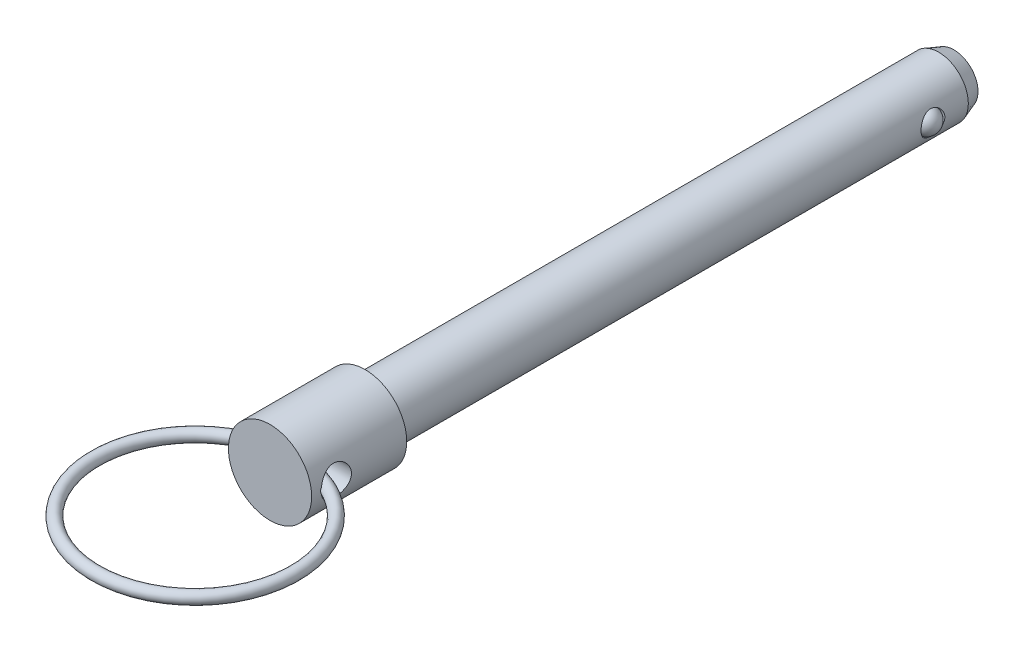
ISO-10303-21;
HEADER;
FILE_DESCRIPTION(('STEP AP214'),'2;1');
FILE_NAME('part.step','',(''),(''),'','','');
FILE_SCHEMA(('AUTOMOTIVE_DESIGN { 1 0 10303 214 1 1 1 1 }'));
ENDSEC;
DATA;
#1=APPLICATION_CONTEXT('core data for automotive mechanical design processes');
#2=APPLICATION_PROTOCOL_DEFINITION('international standard','automotive_design',2000,#1);
#3=PRODUCT_CONTEXT('',#1,'mechanical');
#4=PRODUCT('Part','Part','',(#3));
#5=PRODUCT_RELATED_PRODUCT_CATEGORY('part','',(#4));
#6=PRODUCT_DEFINITION_FORMATION('','',#4);
#7=PRODUCT_DEFINITION_CONTEXT('part definition',#1,'design');
#8=PRODUCT_DEFINITION('design','',#6,#7);
#9=PRODUCT_DEFINITION_SHAPE('','',#8);
#10=(LENGTH_UNIT() NAMED_UNIT(*) SI_UNIT(.MILLI.,.METRE.));
#11=(NAMED_UNIT(*) PLANE_ANGLE_UNIT() SI_UNIT($,.RADIAN.));
#12=(NAMED_UNIT(*) SI_UNIT($,.STERADIAN.) SOLID_ANGLE_UNIT());
#13=UNCERTAINTY_MEASURE_WITH_UNIT(LENGTH_MEASURE(1.E-05),#10,'distance_accuracy_value','');
#14=(GEOMETRIC_REPRESENTATION_CONTEXT(3) GLOBAL_UNCERTAINTY_ASSIGNED_CONTEXT((#13)) GLOBAL_UNIT_ASSIGNED_CONTEXT((#10,
#11,#12)) REPRESENTATION_CONTEXT('',''));
#15=CARTESIAN_POINT('',(0.,0.,0.));
#16=DIRECTION('',(0.,0.,1.));
#17=DIRECTION('',(1.,0.,0.));
#18=AXIS2_PLACEMENT_3D('',#15,#16,#17);
#19=CARTESIAN_POINT('',(7.9375,0.,9.398));
#20=DIRECTION('',(-1.,0.,0.));
#21=DIRECTION('',(0.,0.,-1.));
#22=AXIS2_PLACEMENT_3D('',#19,#20,#21);
#23=CYLINDRICAL_SURFACE('',#22,2.0193);
#24=CARTESIAN_POINT('',(-5.55645,0.41338820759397,11.3745329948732));
#25=CARTESIAN_POINT('',(-5.53323669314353,0.388835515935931,11.3796705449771));
#26=CARTESIAN_POINT('',(-5.51157389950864,0.362641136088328,11.3846690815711));
#27=CARTESIAN_POINT('',(-5.47216390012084,0.307044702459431,11.3940198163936));
#28=CARTESIAN_POINT('',(-5.45444977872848,0.277618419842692,11.3983664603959));
#29=CARTESIAN_POINT('',(-5.42406600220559,0.215851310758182,11.4059720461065));
#30=CARTESIAN_POINT('',(-5.41142802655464,0.183493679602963,11.4092241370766));
#31=CARTESIAN_POINT('',(-5.3923512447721,0.116986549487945,11.4141821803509));
#32=CARTESIAN_POINT('',(-5.38588919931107,0.0828442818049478,11.4158939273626));
#33=CARTESIAN_POINT('',(-5.3799561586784,0.017298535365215,11.4174656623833));
#34=CARTESIAN_POINT('',(-5.37986165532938,-0.0140451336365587,11.4174908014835));
#35=CARTESIAN_POINT('',(-5.38511249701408,-0.0762532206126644,11.4160995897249));
#36=CARTESIAN_POINT('',(-5.39046041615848,-0.107117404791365,11.4146825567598));
#37=CARTESIAN_POINT('',(-5.40574321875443,-0.165640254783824,11.4106965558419));
#38=CARTESIAN_POINT('',(-5.41539031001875,-0.193380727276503,11.408200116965));
#39=CARTESIAN_POINT('',(-5.43862859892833,-0.24707398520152,11.4023097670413));
#40=CARTESIAN_POINT('',(-5.45222392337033,-0.273024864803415,11.398914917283));
#41=CARTESIAN_POINT('',(-5.48024922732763,-0.318737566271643,11.3920973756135));
#42=CARTESIAN_POINT('',(-5.49418727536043,-0.338820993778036,11.3887682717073));
#43=CARTESIAN_POINT('',(-5.523970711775,-0.377330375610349,11.3818282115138));
#44=CARTESIAN_POINT('',(-5.53980753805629,-0.395763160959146,11.378218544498));
#45=CARTESIAN_POINT('',(-5.55645,-0.413388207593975,11.3745329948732));
#46=B_SPLINE_CURVE_WITH_KNOTS('',3,(#24,#25,#26,#27,#28,#29,#30,#31,#32,#33,#34,#35,#36,#37,#38,
#39,#40,#41,#42,#43,#44,#45),.UNSPECIFIED.,.F.,.F.,(4,2,2,2,2,2,2,2,2,2,4),(0.,
0.102621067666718,0.206072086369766,0.310159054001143,0.413852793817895,0.50737645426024,
0.600944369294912,0.689017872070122,0.777183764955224,0.851068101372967,0.924630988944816),.UNSPECIFIED.);
#47=CARTESIAN_POINT('',(-5.54200209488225,0.397651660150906,11.3777589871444));
#48=VERTEX_POINT('',#47);
#49=CARTESIAN_POINT('',(-5.54200209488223,-0.397651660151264,11.3777589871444));
#50=VERTEX_POINT('',#49);
#51=EDGE_CURVE('E40',#48,#50,#46,.T.);
#52=ORIENTED_EDGE('',*,*,#51,.F.);
#53=CARTESIAN_POINT('',(-5.55625,0.,11.4173));
#54=CARTESIAN_POINT('',(-5.55624527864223,-0.109432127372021,11.4172937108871));
#55=CARTESIAN_POINT('',(-5.55298237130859,-0.218969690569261,11.408361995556));
#56=CARTESIAN_POINT('',(-5.54026368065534,-0.434902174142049,11.372953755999));
#57=CARTESIAN_POINT('',(-5.53079819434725,-0.541291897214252,11.3464497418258));
#58=CARTESIAN_POINT('',(-5.50670156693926,-0.747605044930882,11.2769560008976));
#59=CARTESIAN_POINT('',(-5.49208344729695,-0.847544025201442,11.2340078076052));
#60=CARTESIAN_POINT('',(-5.45915039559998,-1.03875753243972,11.1330083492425));
#61=CARTESIAN_POINT('',(-5.44083572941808,-1.13003268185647,11.0749581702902));
#62=CARTESIAN_POINT('',(-5.4015811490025,-1.30505728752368,10.9429422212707));
#63=CARTESIAN_POINT('',(-5.38056990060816,-1.38841141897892,10.8684736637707));
#64=CARTESIAN_POINT('',(-5.33865236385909,-1.54176439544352,10.7067995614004));
#65=CARTESIAN_POINT('',(-5.31774611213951,-1.61175885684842,10.6195898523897));
#66=CARTESIAN_POINT('',(-5.27759352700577,-1.73882919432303,10.4311528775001));
#67=CARTESIAN_POINT('',(-5.25843183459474,-1.79536185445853,10.3295394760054));
#68=CARTESIAN_POINT('',(-5.22503611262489,-1.89036141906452,10.1174402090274));
#69=CARTESIAN_POINT('',(-5.21080023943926,-1.92883508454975,10.0069576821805));
#70=CARTESIAN_POINT('',(-5.18962447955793,-1.98509166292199,9.78477737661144));
#71=CARTESIAN_POINT('',(-5.18242178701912,-2.00362275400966,9.67329490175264));
#72=CARTESIAN_POINT('',(-5.17535625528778,-2.02180769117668,9.44858805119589));
#73=CARTESIAN_POINT('',(-5.17549061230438,-2.02146874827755,9.33536435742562));
#74=CARTESIAN_POINT('',(-5.18285629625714,-2.00249790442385,9.11709454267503));
#75=CARTESIAN_POINT('',(-5.18969215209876,-1.98488533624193,9.01194405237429));
#76=CARTESIAN_POINT('',(-5.20903632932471,-1.93354575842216,8.80620743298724));
#77=CARTESIAN_POINT('',(-5.22154547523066,-1.89981640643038,8.70562196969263));
#78=CARTESIAN_POINT('',(-5.25107746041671,-1.81661001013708,8.50972358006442));
#79=CARTESIAN_POINT('',(-5.26817827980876,-1.76685762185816,8.41453987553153));
#80=CARTESIAN_POINT('',(-5.30493780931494,-1.65321144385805,8.23357336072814));
#81=CARTESIAN_POINT('',(-5.32459724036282,-1.58931366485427,8.14779321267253));
#82=CARTESIAN_POINT('',(-5.36576425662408,-1.44447059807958,7.98240722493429));
#83=CARTESIAN_POINT('',(-5.38731044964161,-1.36270785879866,7.90352531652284));
#84=CARTESIAN_POINT('',(-5.42876622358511,-1.18682967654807,7.76035905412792));
#85=CARTESIAN_POINT('',(-5.44867505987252,-1.09270866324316,7.69608131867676));
#86=CARTESIAN_POINT('',(-5.48497084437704,-0.893001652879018,7.58320896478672));
#87=CARTESIAN_POINT('',(-5.5013029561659,-0.787270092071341,7.53485348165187));
#88=CARTESIAN_POINT('',(-5.52817729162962,-0.568540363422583,7.4569293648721));
#89=CARTESIAN_POINT('',(-5.53873126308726,-0.455557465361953,7.42732259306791));
#90=CARTESIAN_POINT('',(-5.54924569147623,-0.284581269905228,7.39803699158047));
#91=CARTESIAN_POINT('',(-5.55186369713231,-0.227949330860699,7.3907957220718));
#92=CARTESIAN_POINT('',(-5.55536708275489,-0.114221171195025,7.3811255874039));
#93=CARTESIAN_POINT('',(-5.55625246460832,-0.0571249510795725,7.37869671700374));
#94=CARTESIAN_POINT('',(-5.55624527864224,0.109432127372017,7.37870628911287));
#95=CARTESIAN_POINT('',(-5.55298237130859,0.218969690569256,7.38763800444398));
#96=CARTESIAN_POINT('',(-5.54026368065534,0.434902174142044,7.42304624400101));
#97=CARTESIAN_POINT('',(-5.53079819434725,0.541291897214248,7.44955025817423));
#98=CARTESIAN_POINT('',(-5.50670156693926,0.747605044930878,7.51904399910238));
#99=CARTESIAN_POINT('',(-5.49208344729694,0.847544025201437,7.56199219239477));
#100=CARTESIAN_POINT('',(-5.45915039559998,1.03875753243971,7.66299165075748));
#101=CARTESIAN_POINT('',(-5.44083572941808,1.13003268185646,7.72104182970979));
#102=CARTESIAN_POINT('',(-5.4015811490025,1.30505728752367,7.85305777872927));
#103=CARTESIAN_POINT('',(-5.38056990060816,1.38841141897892,7.92752633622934));
#104=CARTESIAN_POINT('',(-5.33865236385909,1.54176439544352,8.08920043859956));
#105=CARTESIAN_POINT('',(-5.31774611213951,1.61175885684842,8.17641014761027));
#106=CARTESIAN_POINT('',(-5.27759352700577,1.73882919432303,8.36484712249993));
#107=CARTESIAN_POINT('',(-5.25843183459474,1.79536185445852,8.46646052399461));
#108=CARTESIAN_POINT('',(-5.22503611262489,1.89036141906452,8.67855979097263));
#109=CARTESIAN_POINT('',(-5.21080023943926,1.92883508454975,8.78904231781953));
#110=CARTESIAN_POINT('',(-5.18962447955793,1.98509166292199,9.01122262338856));
#111=CARTESIAN_POINT('',(-5.18242178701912,2.00362275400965,9.12270509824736));
#112=CARTESIAN_POINT('',(-5.17535625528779,2.02180769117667,9.34741194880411));
#113=CARTESIAN_POINT('',(-5.17549061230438,2.02146874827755,9.46063564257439));
#114=CARTESIAN_POINT('',(-5.18285629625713,2.00249790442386,9.67890545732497));
#115=CARTESIAN_POINT('',(-5.18969215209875,1.98488533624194,9.78405594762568));
#116=CARTESIAN_POINT('',(-5.20903632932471,1.93354575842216,9.98979256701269));
#117=CARTESIAN_POINT('',(-5.22154547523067,1.89981640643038,10.0903780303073));
#118=CARTESIAN_POINT('',(-5.25107746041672,1.81661001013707,10.2862764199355));
#119=CARTESIAN_POINT('',(-5.26817827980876,1.76685762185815,10.3814601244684));
#120=CARTESIAN_POINT('',(-5.30493780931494,1.65321144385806,10.5624266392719));
#121=CARTESIAN_POINT('',(-5.32459724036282,1.58931366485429,10.6482067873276));
#122=CARTESIAN_POINT('',(-5.36576425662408,1.44447059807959,10.8135927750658));
#123=CARTESIAN_POINT('',(-5.38731044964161,1.36270785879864,10.8924746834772));
#124=CARTESIAN_POINT('',(-5.42876622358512,1.18682967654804,11.0356409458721));
#125=CARTESIAN_POINT('',(-5.44867505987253,1.09270866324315,11.0999186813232));
#126=CARTESIAN_POINT('',(-5.48497084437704,0.893001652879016,11.2127910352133));
#127=CARTESIAN_POINT('',(-5.5013029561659,0.787270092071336,11.2611465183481));
#128=CARTESIAN_POINT('',(-5.52817729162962,0.568540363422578,11.3390706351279));
#129=CARTESIAN_POINT('',(-5.53873126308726,0.455557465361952,11.3686774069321));
#130=CARTESIAN_POINT('',(-5.54924569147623,0.284581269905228,11.3979630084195));
#131=CARTESIAN_POINT('',(-5.55186369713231,0.227949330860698,11.4052042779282));
#132=CARTESIAN_POINT('',(-5.5553670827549,0.114221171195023,11.4148744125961));
#133=CARTESIAN_POINT('',(-5.55625246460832,0.0571249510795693,11.4173032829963));
#134=CARTESIAN_POINT('',(-5.55625,0.,11.4173));
#135=B_SPLINE_CURVE_WITH_KNOTS('',3,(#53,#54,#55,#56,#57,#58,#59,#60,#61,#62,#63,#64,#65,#66,
#67,#68,#69,#70,#71,#72,#73,#74,#75,#76,#77,#78,#79,#80,#81,#82,#83,#84,#85,#86,#87,#88,#89,#90,
#91,#92,#93,#94,#95,#96,#97,#98,#99,#100,#101,#102,#103,#104,#105,#106,#107,#108,#109,#110,#111,
#112,#113,#114,#115,#116,#117,#118,#119,#120,#121,#122,#123,#124,#125,#126,#127,#128,#129,#130,
#131,#132,#133,#134),.UNSPECIFIED.,.T.,.F.,(4,2,2,2,2,2,2,2,2,2,2,2,2,2,2,2,2,2,2,2,2,2,2,2,2,2,
2,2,2,2,2,2,2,2,2,2,2,2,2,2,4),(0.,0.328075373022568,0.656665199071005,0.984430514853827,
1.31217226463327,1.65185430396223,1.99164760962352,2.3434350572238,2.69509069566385,
3.03303658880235,3.3708533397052,3.68986542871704,4.00892389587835,4.33378721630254,
4.65874227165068,5.00406386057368,5.34954163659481,5.69999369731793,6.04973056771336,
6.22099023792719,6.39224972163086,6.72032509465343,7.04891492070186,7.37668023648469,
7.70442198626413,8.04410402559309,8.38389733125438,8.73568477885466,9.08734041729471,
9.42528631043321,9.76310306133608,10.0821151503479,10.4011736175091,10.7260369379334,
11.0509919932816,11.3963135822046,11.7417913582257,12.0922434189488,12.4419802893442,
12.6132399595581,12.7844994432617),.UNSPECIFIED.);
#136=EDGE_CURVE('E66',#50,#48,#135,.T.);
#137=ORIENTED_EDGE('',*,*,#136,.F.);
#138=EDGE_LOOP('',(#52,#137));
#139=FACE_BOUND('',#138,.T.);
#140=CARTESIAN_POINT('',(5.55645,-0.413388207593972,11.3745329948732));
#141=CARTESIAN_POINT('',(5.53323669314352,-0.388835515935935,11.3796705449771));
#142=CARTESIAN_POINT('',(5.51157389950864,-0.362641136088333,11.3846690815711));
#143=CARTESIAN_POINT('',(5.47216390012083,-0.307044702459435,11.3940198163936));
#144=CARTESIAN_POINT('',(5.45444977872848,-0.277618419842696,11.3983664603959));
#145=CARTESIAN_POINT('',(5.42406600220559,-0.215851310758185,11.4059720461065));
#146=CARTESIAN_POINT('',(5.41142802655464,-0.183493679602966,11.4092241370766));
#147=CARTESIAN_POINT('',(5.3923512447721,-0.116986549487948,11.4141821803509));
#148=CARTESIAN_POINT('',(5.38588919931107,-0.0828442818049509,11.4158939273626));
#149=CARTESIAN_POINT('',(5.3799561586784,-0.0172985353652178,11.4174656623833));
#150=CARTESIAN_POINT('',(5.37986165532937,0.0140451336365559,11.4174908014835));
#151=CARTESIAN_POINT('',(5.38511249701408,0.0762532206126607,11.4160995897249));
#152=CARTESIAN_POINT('',(5.39046041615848,0.10711740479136,11.4146825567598));
#153=CARTESIAN_POINT('',(5.40574321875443,0.16564025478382,11.4106965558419));
#154=CARTESIAN_POINT('',(5.41539031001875,0.193380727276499,11.408200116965));
#155=CARTESIAN_POINT('',(5.43862859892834,0.247073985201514,11.4023097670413));
#156=CARTESIAN_POINT('',(5.45222392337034,0.273024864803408,11.398914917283));
#157=CARTESIAN_POINT('',(5.48024922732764,0.318737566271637,11.3920973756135));
#158=CARTESIAN_POINT('',(5.49418727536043,0.338820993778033,11.3887682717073));
#159=CARTESIAN_POINT('',(5.523970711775,0.377330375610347,11.3818282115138));
#160=CARTESIAN_POINT('',(5.53980753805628,0.395763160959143,11.378218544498));
#161=CARTESIAN_POINT('',(5.55645,0.413388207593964,11.3745329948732));
#162=B_SPLINE_CURVE_WITH_KNOTS('',3,(#140,#141,#142,#143,#144,#145,#146,#147,#148,#149,#150,
#151,#152,#153,#154,#155,#156,#157,#158,#159,#160,#161),.UNSPECIFIED.,.F.,.F.,(4,2,2,2,2,2,2,2,
2,2,4),(0.,0.102621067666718,0.206072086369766,0.310159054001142,0.413852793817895,
0.507376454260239,0.60094436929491,0.689017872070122,0.777183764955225,0.851068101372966,
0.924630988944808),.UNSPECIFIED.);
#163=CARTESIAN_POINT('',(5.54200209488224,-0.397651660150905,11.3777589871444));
#164=VERTEX_POINT('',#163);
#165=CARTESIAN_POINT('',(5.54200209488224,0.397651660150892,11.3777589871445));
#166=VERTEX_POINT('',#165);
#167=EDGE_CURVE('E33',#164,#166,#162,.T.);
#168=ORIENTED_EDGE('',*,*,#167,.F.);
#169=CARTESIAN_POINT('',(5.55625,0.,7.3787));
#170=CARTESIAN_POINT('',(5.55624527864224,-0.109432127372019,7.37870628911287));
#171=CARTESIAN_POINT('',(5.55298237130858,-0.218969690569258,7.38763800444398));
#172=CARTESIAN_POINT('',(5.54026368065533,-0.434902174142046,7.42304624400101));
#173=CARTESIAN_POINT('',(5.53079819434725,-0.54129189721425,7.44955025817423));
#174=CARTESIAN_POINT('',(5.50670156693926,-0.74760504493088,7.51904399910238));
#175=CARTESIAN_POINT('',(5.49208344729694,-0.847544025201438,7.56199219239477));
#176=CARTESIAN_POINT('',(5.45915039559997,-1.03875753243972,7.66299165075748));
#177=CARTESIAN_POINT('',(5.44083572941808,-1.13003268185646,7.72104182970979));
#178=CARTESIAN_POINT('',(5.4015811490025,-1.30505728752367,7.85305777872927));
#179=CARTESIAN_POINT('',(5.38056990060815,-1.38841141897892,7.92752633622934));
#180=CARTESIAN_POINT('',(5.33865236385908,-1.54176439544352,8.08920043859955));
#181=CARTESIAN_POINT('',(5.31774611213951,-1.61175885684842,8.17641014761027));
#182=CARTESIAN_POINT('',(5.27759352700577,-1.73882919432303,8.36484712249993));
#183=CARTESIAN_POINT('',(5.25843183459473,-1.79536185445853,8.46646052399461));
#184=CARTESIAN_POINT('',(5.22503611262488,-1.89036141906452,8.67855979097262));
#185=CARTESIAN_POINT('',(5.21080023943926,-1.92883508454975,8.78904231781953));
#186=CARTESIAN_POINT('',(5.18962447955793,-1.98509166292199,9.01122262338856));
#187=CARTESIAN_POINT('',(5.18242178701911,-2.00362275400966,9.12270509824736));
#188=CARTESIAN_POINT('',(5.17535625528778,-2.02180769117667,9.34741194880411));
#189=CARTESIAN_POINT('',(5.17549061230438,-2.02146874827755,9.46063564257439));
#190=CARTESIAN_POINT('',(5.18285629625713,-2.00249790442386,9.67890545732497));
#191=CARTESIAN_POINT('',(5.18969215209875,-1.98488533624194,9.78405594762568));
#192=CARTESIAN_POINT('',(5.2090363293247,-1.93354575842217,9.98979256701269));
#193=CARTESIAN_POINT('',(5.22154547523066,-1.89981640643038,10.0903780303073));
#194=CARTESIAN_POINT('',(5.25107746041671,-1.81661001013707,10.2862764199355));
#195=CARTESIAN_POINT('',(5.26817827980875,-1.76685762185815,10.3814601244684));
#196=CARTESIAN_POINT('',(5.30493780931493,-1.65321144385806,10.5624266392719));
#197=CARTESIAN_POINT('',(5.32459724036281,-1.58931366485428,10.6482067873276));
#198=CARTESIAN_POINT('',(5.36576425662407,-1.44447059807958,10.8135927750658));
#199=CARTESIAN_POINT('',(5.3873104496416,-1.36270785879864,10.8924746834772));
#200=CARTESIAN_POINT('',(5.42876622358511,-1.18682967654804,11.0356409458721));
#201=CARTESIAN_POINT('',(5.44867505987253,-1.09270866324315,11.0999186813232));
#202=CARTESIAN_POINT('',(5.48497084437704,-0.893001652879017,11.2127910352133));
#203=CARTESIAN_POINT('',(5.50130295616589,-0.787270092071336,11.2611465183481));
#204=CARTESIAN_POINT('',(5.52817729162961,-0.568540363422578,11.3390706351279));
#205=CARTESIAN_POINT('',(5.53873126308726,-0.455557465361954,11.3686774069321));
#206=CARTESIAN_POINT('',(5.54924569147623,-0.28458126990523,11.3979630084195));
#207=CARTESIAN_POINT('',(5.5518636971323,-0.2279493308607,11.4052042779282));
#208=CARTESIAN_POINT('',(5.55536708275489,-0.114221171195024,11.4148744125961));
#209=CARTESIAN_POINT('',(5.55625246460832,-0.0571249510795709,11.4173032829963));
#210=CARTESIAN_POINT('',(5.55624527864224,0.109432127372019,11.4172937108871));
#211=CARTESIAN_POINT('',(5.55298237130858,0.218969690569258,11.408361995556));
#212=CARTESIAN_POINT('',(5.54026368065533,0.434902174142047,11.372953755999));
#213=CARTESIAN_POINT('',(5.53079819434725,0.54129189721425,11.3464497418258));
#214=CARTESIAN_POINT('',(5.50670156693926,0.747605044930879,11.2769560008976));
#215=CARTESIAN_POINT('',(5.49208344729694,0.847544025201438,11.2340078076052));
#216=CARTESIAN_POINT('',(5.45915039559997,1.03875753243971,11.1330083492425));
#217=CARTESIAN_POINT('',(5.44083572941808,1.13003268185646,11.0749581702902));
#218=CARTESIAN_POINT('',(5.4015811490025,1.30505728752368,10.9429422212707));
#219=CARTESIAN_POINT('',(5.38056990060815,1.38841141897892,10.8684736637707));
#220=CARTESIAN_POINT('',(5.33865236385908,1.54176439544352,10.7067995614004));
#221=CARTESIAN_POINT('',(5.31774611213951,1.61175885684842,10.6195898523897));
#222=CARTESIAN_POINT('',(5.27759352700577,1.73882919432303,10.4311528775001));
#223=CARTESIAN_POINT('',(5.25843183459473,1.79536185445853,10.3295394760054));
#224=CARTESIAN_POINT('',(5.22503611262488,1.89036141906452,10.1174402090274));
#225=CARTESIAN_POINT('',(5.21080023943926,1.92883508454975,10.0069576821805));
#226=CARTESIAN_POINT('',(5.18962447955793,1.98509166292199,9.78477737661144));
#227=CARTESIAN_POINT('',(5.18242178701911,2.00362275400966,9.67329490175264));
#228=CARTESIAN_POINT('',(5.17535625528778,2.02180769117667,9.44858805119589));
#229=CARTESIAN_POINT('',(5.17549061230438,2.02146874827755,9.33536435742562));
#230=CARTESIAN_POINT('',(5.18285629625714,2.00249790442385,9.11709454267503));
#231=CARTESIAN_POINT('',(5.18969215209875,1.98488533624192,9.01194405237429));
#232=CARTESIAN_POINT('',(5.2090363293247,1.93354575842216,8.80620743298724));
#233=CARTESIAN_POINT('',(5.22154547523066,1.89981640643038,8.70562196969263));
#234=CARTESIAN_POINT('',(5.25107746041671,1.81661001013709,8.50972358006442));
#235=CARTESIAN_POINT('',(5.26817827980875,1.76685762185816,8.41453987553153));
#236=CARTESIAN_POINT('',(5.30493780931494,1.65321144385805,8.23357336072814));
#237=CARTESIAN_POINT('',(5.32459724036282,1.58931366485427,8.14779321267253));
#238=CARTESIAN_POINT('',(5.36576425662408,1.44447059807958,7.98240722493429));
#239=CARTESIAN_POINT('',(5.3873104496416,1.36270785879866,7.90352531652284));
#240=CARTESIAN_POINT('',(5.4287662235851,1.18682967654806,7.76035905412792));
#241=CARTESIAN_POINT('',(5.44867505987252,1.09270866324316,7.69608131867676));
#242=CARTESIAN_POINT('',(5.48497084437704,0.893001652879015,7.58320896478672));
#243=CARTESIAN_POINT('',(5.50130295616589,0.787270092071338,7.53485348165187));
#244=CARTESIAN_POINT('',(5.52817729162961,0.568540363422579,7.4569293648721));
#245=CARTESIAN_POINT('',(5.53873126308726,0.45555746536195,7.42732259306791));
#246=CARTESIAN_POINT('',(5.54924569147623,0.284581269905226,7.39803699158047));
#247=CARTESIAN_POINT('',(5.5518636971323,0.227949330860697,7.3907957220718));
#248=CARTESIAN_POINT('',(5.55536708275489,0.114221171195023,7.3811255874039));
#249=CARTESIAN_POINT('',(5.55625246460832,0.05712495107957,7.37869671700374));
#250=CARTESIAN_POINT('',(5.55625,0.,7.3787));
#251=B_SPLINE_CURVE_WITH_KNOTS('',3,(#169,#170,#171,#172,#173,#174,#175,#176,#177,#178,#179,
#180,#181,#182,#183,#184,#185,#186,#187,#188,#189,#190,#191,#192,#193,#194,#195,#196,#197,#198,
#199,#200,#201,#202,#203,#204,#205,#206,#207,#208,#209,#210,#211,#212,#213,#214,#215,#216,#217,
#218,#219,#220,#221,#222,#223,#224,#225,#226,#227,#228,#229,#230,#231,#232,#233,#234,#235,#236,
#237,#238,#239,#240,#241,#242,#243,#244,#245,#246,#247,#248,#249,#250),.UNSPECIFIED.,.T.,.F.,(4,
2,2,2,2,2,2,2,2,2,2,2,2,2,2,2,2,2,2,2,2,2,2,2,2,2,2,2,2,2,2,2,2,2,2,2,2,2,2,2,4),(0.,
0.328075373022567,0.656665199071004,0.984430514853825,1.31217226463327,1.65185430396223,
1.99164760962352,2.34343505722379,2.69509069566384,3.03303658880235,3.37085333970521,
3.68986542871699,4.00892389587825,4.33378721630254,4.65874227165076,5.00406386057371,
5.34954163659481,5.69999369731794,6.04973056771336,6.2209902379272,6.39224972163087,
6.72032509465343,7.04891492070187,7.37668023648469,7.70442198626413,8.04410402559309,
8.38389733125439,8.73568477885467,9.08734041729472,9.42528631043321,9.76310306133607,
10.0821151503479,10.4011736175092,10.7260369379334,11.0509919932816,11.3963135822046,
11.7417913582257,12.0922434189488,12.4419802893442,12.6132399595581,12.7844994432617),.UNSPECIFIED.);
#252=EDGE_CURVE('E62',#166,#164,#251,.T.);
#253=ORIENTED_EDGE('',*,*,#252,.F.);
#254=EDGE_LOOP('',(#168,#253));
#255=FACE_BOUND('',#254,.T.);
#256=ADVANCED_FACE('F14',(#139,#255),#23,.F.);
#257=CARTESIAN_POINT('',(0.,0.,-28.63596));
#258=DIRECTION('',(0.,0.,-1.));
#259=DIRECTION('',(1.,0.,0.));
#260=AXIS2_PLACEMENT_3D('',#257,#258,#259);
#261=CYLINDRICAL_SURFACE('',#260,5.55625);
#262=ORIENTED_EDGE('',*,*,#252,.T.);
#263=CARTESIAN_POINT('',(5.55009347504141,-0.261488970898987,9.78608403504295));
#264=CARTESIAN_POINT('',(5.54812529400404,-0.303251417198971,9.80096224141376));
#265=CARTESIAN_POINT('',(5.5457404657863,-0.343758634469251,9.81942005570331));
#266=CARTESIAN_POINT('',(5.54040847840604,-0.421066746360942,9.86292845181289));
#267=CARTESIAN_POINT('',(5.5374605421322,-0.457862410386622,9.88798816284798));
#268=CARTESIAN_POINT('',(5.53134134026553,-0.526658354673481,9.94386457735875));
#269=CARTESIAN_POINT('',(5.52817046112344,-0.558666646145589,9.97467146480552));
#270=CARTESIAN_POINT('',(5.52194469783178,-0.617178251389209,10.0411137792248));
#271=CARTESIAN_POINT('',(5.51888978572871,-0.64368289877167,10.0767480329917));
#272=CARTESIAN_POINT('',(5.51313628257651,-0.691254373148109,10.1527268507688));
#273=CARTESIAN_POINT('',(5.51044827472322,-0.712171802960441,10.1931655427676));
#274=CARTESIAN_POINT('',(5.50578097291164,-0.747399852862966,10.2768577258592));
#275=CARTESIAN_POINT('',(5.50380188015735,-0.761708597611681,10.3201120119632));
#276=CARTESIAN_POINT('',(5.50062483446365,-0.784334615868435,10.4110491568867));
#277=CARTESIAN_POINT('',(5.4994831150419,-0.792223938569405,10.4588401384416));
#278=CARTESIAN_POINT('',(5.49826873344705,-0.800607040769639,10.5550754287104));
#279=CARTESIAN_POINT('',(5.49819646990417,-0.801098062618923,10.6035199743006));
#280=CARTESIAN_POINT('',(5.49912806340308,-0.794680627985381,10.7039443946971));
#281=CARTESIAN_POINT('',(5.5002216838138,-0.787154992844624,10.7558841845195));
#282=CARTESIAN_POINT('',(5.50347103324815,-0.764103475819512,10.8579332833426));
#283=CARTESIAN_POINT('',(5.5056272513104,-0.748573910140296,10.9080417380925));
#284=CARTESIAN_POINT('',(5.51091051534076,-0.708667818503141,11.0082212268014));
#285=CARTESIAN_POINT('',(5.51408971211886,-0.683800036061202,11.0580951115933));
#286=CARTESIAN_POINT('',(5.52096808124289,-0.625839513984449,11.1528267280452));
#287=CARTESIAN_POINT('',(5.52466742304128,-0.592744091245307,11.197682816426));
#288=CARTESIAN_POINT('',(5.53199718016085,-0.519831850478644,11.2794067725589));
#289=CARTESIAN_POINT('',(5.53562669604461,-0.480224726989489,11.3164602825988));
#290=CARTESIAN_POINT('',(5.54239660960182,-0.394450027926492,11.3820559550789));
#291=CARTESIAN_POINT('',(5.54553772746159,-0.348292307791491,11.4106107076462));
#292=CARTESIAN_POINT('',(5.55042537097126,-0.257766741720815,11.4537693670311));
#293=CARTESIAN_POINT('',(5.55230678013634,-0.214079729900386,11.4697807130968));
#294=CARTESIAN_POINT('',(5.55503790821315,-0.124373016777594,11.4927832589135));
#295=CARTESIAN_POINT('',(5.55588906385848,-0.0783566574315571,11.4997870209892));
#296=CARTESIAN_POINT('',(5.55638432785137,0.00705853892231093,11.5038718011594));
#297=CARTESIAN_POINT('',(5.55619261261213,0.046397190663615,11.5023023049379));
#298=CARTESIAN_POINT('',(5.55499790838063,0.124194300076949,11.4923961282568));
#299=CARTESIAN_POINT('',(5.5539950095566,0.162652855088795,11.484060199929));
#300=CARTESIAN_POINT('',(5.55133569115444,0.23645535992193,11.4614747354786));
#301=CARTESIAN_POINT('',(5.54970019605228,0.27185859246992,11.4474138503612));
#302=CARTESIAN_POINT('',(5.54593788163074,0.340082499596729,11.414086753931));
#303=CARTESIAN_POINT('',(5.54381093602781,0.372902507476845,11.394819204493));
#304=CARTESIAN_POINT('',(5.53902830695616,0.438479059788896,11.3497412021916));
#305=CARTESIAN_POINT('',(5.53634134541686,0.470920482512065,11.3234773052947));
#306=CARTESIAN_POINT('',(5.53084030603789,0.531649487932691,11.2665410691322));
#307=CARTESIAN_POINT('',(5.52802616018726,0.559934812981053,11.2358663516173));
#308=CARTESIAN_POINT('',(5.52207389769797,0.616058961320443,11.1660010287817));
#309=CARTESIAN_POINT('',(5.51895184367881,0.64317151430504,11.1262251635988));
#310=CARTESIAN_POINT('',(5.5131400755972,0.691221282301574,11.0430715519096));
#311=CARTESIAN_POINT('',(5.51045062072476,0.712154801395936,10.9996916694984));
#312=CARTESIAN_POINT('',(5.50546631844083,0.749774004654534,10.9047684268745));
#313=CARTESIAN_POINT('',(5.50326207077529,0.76560827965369,10.8528805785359));
#314=CARTESIAN_POINT('',(5.49999925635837,0.78870713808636,10.7471802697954));
#315=CARTESIAN_POINT('',(5.49894104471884,0.795969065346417,10.693367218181));
#316=CARTESIAN_POINT('',(5.49812737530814,0.801573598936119,10.5836973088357));
#317=CARTESIAN_POINT('',(5.49841008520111,0.799654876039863,10.5278260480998));
#318=CARTESIAN_POINT('',(5.50039129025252,0.785912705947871,10.4173293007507));
#319=CARTESIAN_POINT('',(5.50208922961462,0.774093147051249,10.3627033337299));
#320=CARTESIAN_POINT('',(5.50657222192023,0.741502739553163,10.2600057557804));
#321=CARTESIAN_POINT('',(5.50928213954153,0.721341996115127,10.2117380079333));
#322=CARTESIAN_POINT('',(5.5154579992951,0.672487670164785,10.1197820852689));
#323=CARTESIAN_POINT('',(5.51892350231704,0.643799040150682,10.0760912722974));
#324=CARTESIAN_POINT('',(5.5258260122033,0.581424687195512,9.99852087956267));
#325=CARTESIAN_POINT('',(5.52923968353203,0.548383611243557,9.96412004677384));
#326=CARTESIAN_POINT('',(5.53588272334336,0.476663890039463,9.90178589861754));
#327=CARTESIAN_POINT('',(5.5391121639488,0.437987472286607,9.87385003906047));
#328=CARTESIAN_POINT('',(5.54480401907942,0.358545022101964,9.82683552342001));
#329=CARTESIAN_POINT('',(5.54729992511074,0.318028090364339,9.80733901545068));
#330=CARTESIAN_POINT('',(5.55147034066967,0.234199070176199,9.7755782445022));
#331=CARTESIAN_POINT('',(5.55314476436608,0.190886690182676,9.76331473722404));
#332=CARTESIAN_POINT('',(5.55544526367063,0.103875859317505,9.74662090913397));
#333=CARTESIAN_POINT('',(5.55609634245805,0.0602137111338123,9.74200361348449));
#334=CARTESIAN_POINT('',(5.55635470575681,-0.0272293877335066,9.74015977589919));
#335=CARTESIAN_POINT('',(5.5559634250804,-0.0710100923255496,9.74292307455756));
#336=CARTESIAN_POINT('',(5.55456091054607,-0.139289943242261,9.75303365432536));
#337=CARTESIAN_POINT('',(5.55387840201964,-0.164176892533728,9.75797314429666));
#338=CARTESIAN_POINT('',(5.55220711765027,-0.213342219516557,9.77024669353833));
#339=CARTESIAN_POINT('',(5.55121834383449,-0.237620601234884,9.77758073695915));
#340=CARTESIAN_POINT('',(5.55009347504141,-0.261488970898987,9.78608403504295));
#341=B_SPLINE_CURVE_WITH_KNOTS('',3,(#263,#264,#265,#266,#267,#268,#269,#270,#271,#272,#273,
#274,#275,#276,#277,#278,#279,#280,#281,#282,#283,#284,#285,#286,#287,#288,#289,#290,#291,#292,
#293,#294,#295,#296,#297,#298,#299,#300,#301,#302,#303,#304,#305,#306,#307,#308,#309,#310,#311,
#312,#313,#314,#315,#316,#317,#318,#319,#320,#321,#322,#323,#324,#325,#326,#327,#328,#329,#330,
#331,#332,#333,#334,#335,#336,#337,#338,#339,#340),.UNSPECIFIED.,.T.,.F.,(4,2,2,2,2,2,2,2,2,2,2,
2,2,2,2,2,2,2,2,2,2,2,2,2,2,2,2,2,2,2,2,2,2,2,2,2,2,2,4),(0.,0.133035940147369,
0.266256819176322,0.399252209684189,0.532215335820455,0.668441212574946,0.804705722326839,
0.949444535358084,1.09423729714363,1.25104087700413,1.40791668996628,1.57457416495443,
1.7412860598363,1.90341673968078,2.06530602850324,2.20414603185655,2.34279219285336,
2.46030997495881,2.57781469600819,2.69172579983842,2.80566620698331,2.9306617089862,
3.05572486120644,3.19986521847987,3.34409161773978,3.5062449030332,3.66844841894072,
3.83529611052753,4.00207830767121,4.15836501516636,4.31456113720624,4.45728171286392,
4.59994602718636,4.73438372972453,4.86883547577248,4.99994808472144,5.13088030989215,
5.20691445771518,5.28294810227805),.UNSPECIFIED.);
#342=EDGE_CURVE('E27',#164,#166,#341,.T.);
#343=ORIENTED_EDGE('',*,*,#342,.T.);
#344=EDGE_LOOP('',(#262,#343));
#345=FACE_BOUND('',#344,.T.);
#346=CARTESIAN_POINT('',(0.,0.,-8.27046764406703E-11));
#347=DIRECTION('',(0.,0.,-1.));
#348=DIRECTION('',(1.,0.,0.));
#349=AXIS2_PLACEMENT_3D('',#346,#347,#348);
#350=CIRCLE('',#349,5.55625000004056);
#351=CARTESIAN_POINT('',(5.55625000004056,0.,-8.2704921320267E-11));
#352=VERTEX_POINT('',#351);
#353=EDGE_CURVE('E70',#352,#352,#350,.T.);
#354=ORIENTED_EDGE('',*,*,#353,.F.);
#355=EDGE_LOOP('',(#354));
#356=FACE_BOUND('',#355,.T.);
#357=CARTESIAN_POINT('',(0.,0.,12.7000000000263));
#358=DIRECTION('',(0.,0.,-1.));
#359=DIRECTION('',(1.,0.,0.));
#360=AXIS2_PLACEMENT_3D('',#357,#358,#359);
#361=CIRCLE('',#360,5.55625000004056);
#362=CARTESIAN_POINT('',(5.55625000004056,0.,12.7000000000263));
#363=VERTEX_POINT('',#362);
#364=EDGE_CURVE('E60',#363,#363,#361,.T.);
#365=ORIENTED_EDGE('',*,*,#364,.T.);
#366=EDGE_LOOP('',(#365));
#367=FACE_BOUND('',#366,.T.);
#368=ORIENTED_EDGE('',*,*,#136,.T.);
#369=CARTESIAN_POINT('',(-5.55009347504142,-0.261488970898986,9.78608403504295));
#370=CARTESIAN_POINT('',(-5.55201952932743,-0.220600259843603,9.77152029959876));
#371=CARTESIAN_POINT('',(-5.55354800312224,-0.178464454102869,9.76037150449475));
#372=CARTESIAN_POINT('',(-5.5556384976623,-0.0928868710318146,9.74524129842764));
#373=CARTESIAN_POINT('',(-5.55620009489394,-0.0494445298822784,9.74126302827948));
#374=CARTESIAN_POINT('',(-5.55629347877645,0.0374935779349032,9.74059719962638));
#375=CARTESIAN_POINT('',(-5.55582538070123,0.0809893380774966,9.74390882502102));
#376=CARTESIAN_POINT('',(-5.55391173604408,0.166795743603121,9.75772411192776));
#377=CARTESIAN_POINT('',(-5.5524662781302,0.209106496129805,9.7682271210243));
#378=CARTESIAN_POINT('',(-5.54875885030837,0.291350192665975,9.7961125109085));
#379=CARTESIAN_POINT('',(-5.54649699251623,0.331283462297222,9.81349394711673));
#380=CARTESIAN_POINT('',(-5.54140563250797,0.407683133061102,9.8546186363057));
#381=CARTESIAN_POINT('',(-5.53857612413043,0.444149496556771,9.87836195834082));
#382=CARTESIAN_POINT('',(-5.53262152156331,0.513054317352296,9.93180289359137));
#383=CARTESIAN_POINT('',(-5.52949345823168,0.545442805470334,9.96156453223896));
#384=CARTESIAN_POINT('',(-5.52330278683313,0.604927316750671,10.0259730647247));
#385=CARTESIAN_POINT('',(-5.52024018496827,0.632022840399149,10.0606204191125));
#386=CARTESIAN_POINT('',(-5.51440051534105,0.681126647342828,10.1349305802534));
#387=CARTESIAN_POINT('',(-5.51163525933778,0.702950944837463,10.1747156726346));
#388=CARTESIAN_POINT('',(-5.50677513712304,0.740062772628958,10.2572565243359));
#389=CARTESIAN_POINT('',(-5.50468043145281,0.755348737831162,10.3000129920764));
#390=CARTESIAN_POINT('',(-5.50124315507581,0.780002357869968,10.3899815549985));
#391=CARTESIAN_POINT('',(-5.49995301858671,0.788961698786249,10.4373072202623));
#392=CARTESIAN_POINT('',(-5.498425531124,0.799536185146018,10.532783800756));
#393=CARTESIAN_POINT('',(-5.49818856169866,0.801148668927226,10.580935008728));
#394=CARTESIAN_POINT('',(-5.49877665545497,0.797104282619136,10.6808979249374));
#395=CARTESIAN_POINT('',(-5.49969077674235,0.790837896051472,10.7326845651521));
#396=CARTESIAN_POINT('',(-5.502598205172,0.770345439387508,10.8346351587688));
#397=CARTESIAN_POINT('',(-5.50459199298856,0.756115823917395,10.8847983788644));
#398=CARTESIAN_POINT('',(-5.50958513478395,0.718862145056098,10.9855133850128));
#399=CARTESIAN_POINT('',(-5.51264228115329,0.695318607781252,11.0358713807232));
#400=CARTESIAN_POINT('',(-5.51933971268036,0.63998268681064,11.131851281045));
#401=CARTESIAN_POINT('',(-5.5229802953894,0.608186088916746,11.177470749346));
#402=CARTESIAN_POINT('',(-5.53030695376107,0.537456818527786,11.2614236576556));
#403=CARTESIAN_POINT('',(-5.53399100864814,0.498663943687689,11.2998741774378));
#404=CARTESIAN_POINT('',(-5.54094301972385,0.414294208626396,11.3684444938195));
#405=CARTESIAN_POINT('',(-5.54421186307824,0.368732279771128,11.398582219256));
#406=CARTESIAN_POINT('',(-5.54902610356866,0.285409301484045,11.4415518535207));
#407=CARTESIAN_POINT('',(-5.55079831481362,0.248931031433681,11.4568629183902));
#408=CARTESIAN_POINT('',(-5.55365405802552,0.173909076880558,11.4812007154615));
#409=CARTESIAN_POINT('',(-5.55473812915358,0.135367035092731,11.4902323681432));
#410=CARTESIAN_POINT('',(-5.55609389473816,0.0571634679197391,11.5014913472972));
#411=CARTESIAN_POINT('',(-5.55636320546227,0.0174989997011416,11.5036987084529));
#412=CARTESIAN_POINT('',(-5.55604928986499,-0.0615987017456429,11.5011080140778));
#413=CARTESIAN_POINT('',(-5.55546601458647,-0.101031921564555,11.4963095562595));
#414=CARTESIAN_POINT('',(-5.55356355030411,-0.176675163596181,11.4803936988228));
#415=CARTESIAN_POINT('',(-5.55227928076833,-0.212950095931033,11.4695756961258));
#416=CARTESIAN_POINT('',(-5.54913333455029,-0.28333026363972,11.4424161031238));
#417=CARTESIAN_POINT('',(-5.54727154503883,-0.317435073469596,11.4260734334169));
#418=CARTESIAN_POINT('',(-5.54300097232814,-0.385072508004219,11.3872975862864));
#419=CARTESIAN_POINT('',(-5.54056357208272,-0.418407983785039,11.3645254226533));
#420=CARTESIAN_POINT('',(-5.53544762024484,-0.481387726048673,11.3143838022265));
#421=CARTESIAN_POINT('',(-5.53276895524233,-0.511030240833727,11.2870121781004));
#422=CARTESIAN_POINT('',(-5.52699292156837,-0.570330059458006,11.2242365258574));
#423=CARTESIAN_POINT('',(-5.52389129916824,-0.599362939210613,11.1882432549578));
#424=CARTESIAN_POINT('',(-5.51794192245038,-0.651866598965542,11.1123875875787));
#425=CARTESIAN_POINT('',(-5.51509432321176,-0.675333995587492,11.0725228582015));
#426=CARTESIAN_POINT('',(-5.50953849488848,-0.719347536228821,10.9840543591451));
#427=CARTESIAN_POINT('',(-5.50690598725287,-0.739020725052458,10.9350095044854));
#428=CARTESIAN_POINT('',(-5.50259788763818,-0.77044298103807,10.8343900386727));
#429=CARTESIAN_POINT('',(-5.50092272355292,-0.782188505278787,10.782814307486));
#430=CARTESIAN_POINT('',(-5.49868146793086,-0.797800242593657,10.6753545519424));
#431=CARTESIAN_POINT('',(-5.49818587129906,-0.801166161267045,10.6193948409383));
#432=CARTESIAN_POINT('',(-5.49862892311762,-0.79812137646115,10.5077343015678));
#433=CARTESIAN_POINT('',(-5.49956724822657,-0.791712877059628,10.452033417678));
#434=CARTESIAN_POINT('',(-5.5027408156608,-0.769336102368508,10.3451160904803));
#435=CARTESIAN_POINT('',(-5.50491833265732,-0.753792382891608,10.2938098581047));
#436=CARTESIAN_POINT('',(-5.51027934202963,-0.713544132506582,10.1949693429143));
#437=CARTESIAN_POINT('',(-5.51346234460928,-0.688844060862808,10.1474332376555));
#438=CARTESIAN_POINT('',(-5.52010275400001,-0.633315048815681,10.0619154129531));
#439=CARTESIAN_POINT('',(-5.52351228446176,-0.603205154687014,10.0234624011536));
#440=CARTESIAN_POINT('',(-5.53038590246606,-0.53652777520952,9.9526689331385));
#441=CARTESIAN_POINT('',(-5.53384993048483,-0.499966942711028,9.92032224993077));
#442=CARTESIAN_POINT('',(-5.53964550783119,-0.430319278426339,9.86936528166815));
#443=CARTESIAN_POINT('',(-5.54205683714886,-0.398291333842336,9.8493012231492));
#444=CARTESIAN_POINT('',(-5.54644342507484,-0.331652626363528,9.81399262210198));
#445=CARTESIAN_POINT('',(-5.54841874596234,-0.297042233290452,9.79874739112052));
#446=CARTESIAN_POINT('',(-5.55009347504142,-0.261488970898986,9.78608403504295));
#447=B_SPLINE_CURVE_WITH_KNOTS('',3,(#369,#370,#371,#372,#373,#374,#375,#376,#377,#378,#379,
#380,#381,#382,#383,#384,#385,#386,#387,#388,#389,#390,#391,#392,#393,#394,#395,#396,#397,#398,
#399,#400,#401,#402,#403,#404,#405,#406,#407,#408,#409,#410,#411,#412,#413,#414,#415,#416,#417,
#418,#419,#420,#421,#422,#423,#424,#425,#426,#427,#428,#429,#430,#431,#432,#433,#434,#435,#436,
#437,#438,#439,#440,#441,#442,#443,#444,#445,#446),.UNSPECIFIED.,.T.,.F.,(4,2,2,2,2,2,2,2,2,2,2,
2,2,2,2,2,2,2,2,2,2,2,2,2,2,2,2,2,2,2,2,2,2,2,2,2,2,2,4),(0.,0.130208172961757,
0.260473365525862,0.390723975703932,0.520962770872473,0.651183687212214,0.781406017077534,
0.91309442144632,1.04479524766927,1.18058351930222,1.31640427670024,1.46034248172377,
1.604332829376,1.76017982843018,1.91609626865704,2.08232629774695,2.24864137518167,
2.41194177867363,2.57488717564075,2.69318920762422,2.81139843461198,2.9299531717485,
3.04851471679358,3.16164747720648,3.27480235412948,3.39566347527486,3.51658170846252,
3.65508000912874,3.79366229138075,3.9517047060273,4.10981770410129,4.27716593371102,
4.44447643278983,4.60456550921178,4.76457672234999,4.91068415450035,5.05664177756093,
5.16987565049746,5.28309333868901),.UNSPECIFIED.);
#448=EDGE_CURVE('E9',#48,#50,#447,.T.);
#449=ORIENTED_EDGE('',*,*,#448,.T.);
#450=EDGE_LOOP('',(#368,#449));
#451=FACE_BOUND('',#450,.T.);
#452=ADVANCED_FACE('F64',(#345,#356,#367,#451),#261,.T.);
#453=CARTESIAN_POINT('',(0.,0.,0.));
#454=DIRECTION('',(0.,0.,-1.));
#455=DIRECTION('',(-1.,0.,0.));
#456=AXIS2_PLACEMENT_3D('',#453,#454,#455);
#457=PLANE('',#456);
#458=ORIENTED_EDGE('',*,*,#353,.T.);
#459=EDGE_LOOP('',(#458));
#460=FACE_BOUND('',#459,.T.);
#461=CARTESIAN_POINT('',(0.,0.,0.));
#462=DIRECTION('',(0.,0.,-1.));
#463=DIRECTION('',(-1.,0.,0.));
#464=AXIS2_PLACEMENT_3D('',#461,#462,#463);
#465=CIRCLE('',#464,3.95605);
#466=CARTESIAN_POINT('',(-3.95605,0.,0.));
#467=VERTEX_POINT('',#466);
#468=EDGE_CURVE('E67',#467,#467,#465,.T.);
#469=ORIENTED_EDGE('',*,*,#468,.F.);
#470=EDGE_LOOP('',(#469));
#471=FACE_BOUND('',#470,.T.);
#472=ADVANCED_FACE('F16',(#460,#471),#457,.T.);
#473=CARTESIAN_POINT('',(0.,-5.30225,12.7));
#474=DIRECTION('',(0.,0.,1.));
#475=DIRECTION('',(-1.,0.,0.));
#476=AXIS2_PLACEMENT_3D('',#473,#474,#475);
#477=PLANE('',#476);
#478=ORIENTED_EDGE('',*,*,#364,.F.);
#479=EDGE_LOOP('',(#478));
#480=FACE_BOUND('',#479,.T.);
#481=ADVANCED_FACE('F181',(#480),#477,.T.);
#482=CARTESIAN_POINT('',(0.,0.,500000.));
#483=DIRECTION('',(0.,0.,-1.));
#484=DIRECTION('',(-1.,0.,0.));
#485=AXIS2_PLACEMENT_3D('',#482,#483,#484);
#486=CYLINDRICAL_SURFACE('',#485,3.95605);
#487=ORIENTED_EDGE('',*,*,#468,.T.);
#488=EDGE_LOOP('',(#487));
#489=FACE_BOUND('',#488,.T.);
#490=CARTESIAN_POINT('',(3.95605,0.,-70.29206));
#491=CARTESIAN_POINT('',(3.95604605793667,0.0853977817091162,-70.2920649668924));
#492=CARTESIAN_POINT('',(3.95325565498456,0.170869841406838,-70.2989843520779));
#493=CARTESIAN_POINT('',(3.9423774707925,0.339330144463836,-70.3263965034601));
#494=CARTESIAN_POINT('',(3.93428211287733,0.42231465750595,-70.3469086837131));
#495=CARTESIAN_POINT('',(3.91366462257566,0.583199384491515,-70.4006392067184));
#496=CARTESIAN_POINT('',(3.90115492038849,0.661113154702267,-70.4338218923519));
#497=CARTESIAN_POINT('',(3.87293592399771,0.810225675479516,-70.5117972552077));
#498=CARTESIAN_POINT('',(3.85722666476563,0.881424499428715,-70.5565898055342));
#499=CARTESIAN_POINT('',(3.82336924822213,1.01851810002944,-70.6587424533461));
#500=CARTESIAN_POINT('',(3.80514523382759,1.0840528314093,-70.7165603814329));
#501=CARTESIAN_POINT('',(3.76865795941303,1.20479657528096,-70.8421520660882));
#502=CARTESIAN_POINT('',(3.75039468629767,1.26000131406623,-70.9099299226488));
#503=CARTESIAN_POINT('',(3.71498321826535,1.36096514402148,-71.0572149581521));
#504=CARTESIAN_POINT('',(3.69792187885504,1.40618899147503,-71.1371120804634));
#505=CARTESIAN_POINT('',(3.66804079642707,1.4823954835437,-71.3041669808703));
#506=CARTESIAN_POINT('',(3.65521908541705,1.51338473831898,-71.3913213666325));
#507=CARTESIAN_POINT('',(3.63608657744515,1.55877880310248,-71.5662662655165));
#508=CARTESIAN_POINT('',(3.62950564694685,1.57387516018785,-71.6538467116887));
#509=CARTESIAN_POINT('',(3.62281725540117,1.58921493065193,-71.8305259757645));
#510=CARTESIAN_POINT('',(3.62270658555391,1.58946570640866,-71.9196240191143));
#511=CARTESIAN_POINT('',(3.62874096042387,1.5756309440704,-72.0901463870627));
#512=CARTESIAN_POINT('',(3.63444787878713,1.5625494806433,-72.1716706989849));
#513=CARTESIAN_POINT('',(3.65073868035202,1.52409646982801,-72.3312515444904));
#514=CARTESIAN_POINT('',(3.66132342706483,1.49872274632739,-72.4093074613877));
#515=CARTESIAN_POINT('',(3.68641045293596,1.43592091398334,-72.5616270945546));
#516=CARTESIAN_POINT('',(3.70098859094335,1.39825636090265,-72.6357802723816));
#517=CARTESIAN_POINT('',(3.73239843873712,1.31210960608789,-72.7769845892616));
#518=CARTESIAN_POINT('',(3.74923090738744,1.26362375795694,-72.8440333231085));
#519=CARTESIAN_POINT('',(3.78484685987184,1.15278197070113,-72.9746131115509));
#520=CARTESIAN_POINT('',(3.80368030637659,1.08964096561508,-73.0374658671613));
#521=CARTESIAN_POINT('',(3.84007052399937,0.953493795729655,-73.1519268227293));
#522=CARTESIAN_POINT('',(3.85762667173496,0.880482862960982,-73.2035295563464));
#523=CARTESIAN_POINT('',(3.88993279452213,0.724712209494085,-73.2949292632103));
#524=CARTESIAN_POINT('',(3.9046174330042,0.641782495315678,-73.3344608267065));
#525=CARTESIAN_POINT('',(3.92901118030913,0.469788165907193,-73.3987196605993));
#526=CARTESIAN_POINT('',(3.93873025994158,0.380736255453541,-73.4234766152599));
#527=CARTESIAN_POINT('',(3.94891240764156,0.242349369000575,-73.4492066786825));
#528=CARTESIAN_POINT('',(3.95157915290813,0.194170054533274,-73.455890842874));
#529=CARTESIAN_POINT('',(3.95514906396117,0.0973352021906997,-73.4648188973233));
#530=CARTESIAN_POINT('',(3.95605224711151,0.0486796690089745,-73.4670628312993));
#531=CARTESIAN_POINT('',(3.95604605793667,-0.0853977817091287,-73.4670550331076));
#532=CARTESIAN_POINT('',(3.95325565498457,-0.170869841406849,-73.4601356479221));
#533=CARTESIAN_POINT('',(3.9423774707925,-0.339330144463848,-73.4327234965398));
#534=CARTESIAN_POINT('',(3.93428211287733,-0.422314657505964,-73.4122113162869));
#535=CARTESIAN_POINT('',(3.91366462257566,-0.583199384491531,-73.3584807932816));
#536=CARTESIAN_POINT('',(3.90115492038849,-0.661113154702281,-73.325298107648));
#537=CARTESIAN_POINT('',(3.87293592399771,-0.81022567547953,-73.2473227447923));
#538=CARTESIAN_POINT('',(3.85722666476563,-0.881424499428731,-73.2025301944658));
#539=CARTESIAN_POINT('',(3.82336924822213,-1.01851810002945,-73.1003775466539));
#540=CARTESIAN_POINT('',(3.80514523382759,-1.08405283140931,-73.042559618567));
#541=CARTESIAN_POINT('',(3.76865795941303,-1.20479657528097,-72.9169679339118));
#542=CARTESIAN_POINT('',(3.75039468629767,-1.26000131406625,-72.8491900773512));
#543=CARTESIAN_POINT('',(3.71498321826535,-1.3609651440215,-72.7019050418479));
#544=CARTESIAN_POINT('',(3.69792187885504,-1.40618899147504,-72.6220079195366));
#545=CARTESIAN_POINT('',(3.66804079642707,-1.48239548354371,-72.4549530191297));
#546=CARTESIAN_POINT('',(3.65521908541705,-1.51338473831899,-72.3677986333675));
#547=CARTESIAN_POINT('',(3.63608657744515,-1.55877880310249,-72.1928537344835));
#548=CARTESIAN_POINT('',(3.62950564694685,-1.57387516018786,-72.1052732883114));
#549=CARTESIAN_POINT('',(3.62281725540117,-1.58921493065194,-71.9285940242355));
#550=CARTESIAN_POINT('',(3.62270658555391,-1.58946570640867,-71.8394959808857));
#551=CARTESIAN_POINT('',(3.62874096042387,-1.57563094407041,-71.6689736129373));
#552=CARTESIAN_POINT('',(3.63444787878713,-1.56254948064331,-71.5874493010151));
#553=CARTESIAN_POINT('',(3.65073868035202,-1.52409646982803,-71.4278684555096));
#554=CARTESIAN_POINT('',(3.66132342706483,-1.49872274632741,-71.3498125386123));
#555=CARTESIAN_POINT('',(3.68641045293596,-1.43592091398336,-71.1974929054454));
#556=CARTESIAN_POINT('',(3.70098859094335,-1.39825636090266,-71.1233397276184));
#557=CARTESIAN_POINT('',(3.73239843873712,-1.31210960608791,-70.9821354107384));
#558=CARTESIAN_POINT('',(3.74923090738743,-1.26362375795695,-70.9150866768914));
#559=CARTESIAN_POINT('',(3.78484685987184,-1.15278197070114,-70.7845068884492));
#560=CARTESIAN_POINT('',(3.80368030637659,-1.0896409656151,-70.7216541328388));
#561=CARTESIAN_POINT('',(3.84007052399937,-0.95349379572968,-70.6071931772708));
#562=CARTESIAN_POINT('',(3.85762667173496,-0.880482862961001,-70.5555904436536));
#563=CARTESIAN_POINT('',(3.88993279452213,-0.7247122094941,-70.4641907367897));
#564=CARTESIAN_POINT('',(3.9046174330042,-0.641782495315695,-70.4246591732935));
#565=CARTESIAN_POINT('',(3.92901118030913,-0.46978816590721,-70.3604003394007));
#566=CARTESIAN_POINT('',(3.93873025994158,-0.380736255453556,-70.3356433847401));
#567=CARTESIAN_POINT('',(3.94891240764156,-0.242349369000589,-70.3099133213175));
#568=CARTESIAN_POINT('',(3.95157915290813,-0.194170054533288,-70.303229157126));
#569=CARTESIAN_POINT('',(3.95514906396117,-0.0973352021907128,-70.2943011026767));
#570=CARTESIAN_POINT('',(3.95605224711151,-0.0486796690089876,-70.2920571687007));
#571=CARTESIAN_POINT('',(3.95605,0.,-70.29206));
#572=B_SPLINE_CURVE_WITH_KNOTS('',3,(#490,#491,#492,#493,#494,#495,#496,#497,#498,#499,#500,
#501,#502,#503,#504,#505,#506,#507,#508,#509,#510,#511,#512,#513,#514,#515,#516,#517,#518,#519,
#520,#521,#522,#523,#524,#525,#526,#527,#528,#529,#530,#531,#532,#533,#534,#535,#536,#537,#538,
#539,#540,#541,#542,#543,#544,#545,#546,#547,#548,#549,#550,#551,#552,#553,#554,#555,#556,#557,
#558,#559,#560,#561,#562,#563,#564,#565,#566,#567,#568,#569,#570,#571),.UNSPECIFIED.,.T.,.F.,(4,
2,2,2,2,2,2,2,2,2,2,2,2,2,2,2,2,2,2,2,2,2,2,2,2,2,2,2,2,2,2,2,2,2,2,2,2,2,2,2,4),(0.,
0.256004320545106,0.512375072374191,0.768029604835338,1.02368134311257,1.29033336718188,
1.55709546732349,1.83583223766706,2.11443943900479,2.38034753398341,2.64612375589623,
2.89326290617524,3.14044582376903,3.39269582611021,3.64503095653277,3.9169758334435,
4.18905255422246,4.46674016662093,4.74386797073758,4.8898006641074,5.03573192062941,
5.29173624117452,5.5481069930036,5.80376152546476,6.05941326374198,6.3260652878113,
6.5928273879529,6.87156415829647,7.15017135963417,7.41607945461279,7.68185567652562,
7.92899482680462,8.17617774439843,8.42842774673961,8.68076287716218,8.95270775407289,
9.22478447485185,9.50247208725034,9.77959989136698,9.9255325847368,10.0714638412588),.UNSPECIFIED.);
#573=CARTESIAN_POINT('',(3.95605,0.,-70.29206));
#574=VERTEX_POINT('',#573);
#575=EDGE_CURVE('E121',#574,#574,#572,.T.);
#576=ORIENTED_EDGE('',*,*,#575,.T.);
#577=EDGE_LOOP('',(#576));
#578=FACE_BOUND('',#577,.T.);
#579=CARTESIAN_POINT('',(0.,0.,-76.60396));
#580=DIRECTION('',(0.,0.,-1.));
#581=DIRECTION('',(-1.,0.,0.));
#582=AXIS2_PLACEMENT_3D('',#579,#580,#581);
#583=CIRCLE('',#582,3.95605);
#584=CARTESIAN_POINT('',(-3.95604999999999,0.,-76.60396));
#585=VERTEX_POINT('',#584);
#586=EDGE_CURVE('E128',#585,#585,#583,.F.);
#587=ORIENTED_EDGE('',*,*,#586,.T.);
#588=EDGE_LOOP('',(#587));
#589=FACE_BOUND('',#588,.T.);
#590=CARTESIAN_POINT('',(-3.95605,0.,-73.46706));
#591=CARTESIAN_POINT('',(-3.95604605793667,0.0853977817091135,-73.4670550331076));
#592=CARTESIAN_POINT('',(-3.95325565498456,0.170869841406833,-73.4601356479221));
#593=CARTESIAN_POINT('',(-3.94237747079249,0.339330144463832,-73.4327234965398));
#594=CARTESIAN_POINT('',(-3.93428211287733,0.422314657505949,-73.4122113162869));
#595=CARTESIAN_POINT('',(-3.91366462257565,0.583199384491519,-73.3584807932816));
#596=CARTESIAN_POINT('',(-3.90115492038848,0.661113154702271,-73.325298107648));
#597=CARTESIAN_POINT('',(-3.8729359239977,0.810225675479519,-73.2473227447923));
#598=CARTESIAN_POINT('',(-3.85722666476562,0.881424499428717,-73.2025301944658));
#599=CARTESIAN_POINT('',(-3.82336924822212,1.01851810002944,-73.1003775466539));
#600=CARTESIAN_POINT('',(-3.80514523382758,1.0840528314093,-73.0425596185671));
#601=CARTESIAN_POINT('',(-3.76865795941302,1.20479657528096,-72.9169679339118));
#602=CARTESIAN_POINT('',(-3.75039468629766,1.26000131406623,-72.8491900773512));
#603=CARTESIAN_POINT('',(-3.71498321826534,1.36096514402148,-72.7019050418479));
#604=CARTESIAN_POINT('',(-3.69792187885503,1.40618899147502,-72.6220079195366));
#605=CARTESIAN_POINT('',(-3.66804079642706,1.4823954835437,-72.4549530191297));
#606=CARTESIAN_POINT('',(-3.65521908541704,1.51338473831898,-72.3677986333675));
#607=CARTESIAN_POINT('',(-3.63608657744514,1.55877880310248,-72.1928537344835));
#608=CARTESIAN_POINT('',(-3.62950564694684,1.57387516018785,-72.1052732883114));
#609=CARTESIAN_POINT('',(-3.62281725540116,1.58921493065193,-71.9285940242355));
#610=CARTESIAN_POINT('',(-3.6227065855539,1.58946570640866,-71.8394959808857));
#611=CARTESIAN_POINT('',(-3.62874096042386,1.5756309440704,-71.6689736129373));
#612=CARTESIAN_POINT('',(-3.63444787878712,1.5625494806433,-71.5874493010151));
#613=CARTESIAN_POINT('',(-3.65073868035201,1.52409646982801,-71.4278684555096));
#614=CARTESIAN_POINT('',(-3.66132342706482,1.49872274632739,-71.3498125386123));
#615=CARTESIAN_POINT('',(-3.68641045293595,1.43592091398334,-71.1974929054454));
#616=CARTESIAN_POINT('',(-3.70098859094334,1.39825636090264,-71.1233397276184));
#617=CARTESIAN_POINT('',(-3.73239843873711,1.31210960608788,-70.9821354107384));
#618=CARTESIAN_POINT('',(-3.74923090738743,1.26362375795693,-70.9150866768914));
#619=CARTESIAN_POINT('',(-3.78484685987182,1.15278197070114,-70.7845068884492));
#620=CARTESIAN_POINT('',(-3.80368030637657,1.08964096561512,-70.7216541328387));
#621=CARTESIAN_POINT('',(-3.84007052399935,0.953493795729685,-70.6071931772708));
#622=CARTESIAN_POINT('',(-3.85762667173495,0.880482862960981,-70.5555904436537));
#623=CARTESIAN_POINT('',(-3.88993279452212,0.724712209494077,-70.4641907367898));
#624=CARTESIAN_POINT('',(-3.90461743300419,0.641782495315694,-70.4246591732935));
#625=CARTESIAN_POINT('',(-3.92901118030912,0.469788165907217,-70.3604003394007));
#626=CARTESIAN_POINT('',(-3.93873025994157,0.380736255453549,-70.3356433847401));
#627=CARTESIAN_POINT('',(-3.94891240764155,0.242349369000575,-70.3099133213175));
#628=CARTESIAN_POINT('',(-3.95157915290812,0.194170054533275,-70.303229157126));
#629=CARTESIAN_POINT('',(-3.95514906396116,0.0973352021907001,-70.2943011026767));
#630=CARTESIAN_POINT('',(-3.95605224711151,0.0486796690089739,-70.2920571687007));
#631=CARTESIAN_POINT('',(-3.95604605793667,-0.0853977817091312,-70.2920649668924));
#632=CARTESIAN_POINT('',(-3.95325565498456,-0.170869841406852,-70.2989843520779));
#633=CARTESIAN_POINT('',(-3.94237747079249,-0.33933014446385,-70.3263965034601));
#634=CARTESIAN_POINT('',(-3.93428211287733,-0.422314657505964,-70.3469086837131));
#635=CARTESIAN_POINT('',(-3.91366462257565,-0.583199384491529,-70.4006392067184));
#636=CARTESIAN_POINT('',(-3.90115492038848,-0.661113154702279,-70.4338218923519));
#637=CARTESIAN_POINT('',(-3.8729359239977,-0.810225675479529,-70.5117972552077));
#638=CARTESIAN_POINT('',(-3.85722666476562,-0.88142449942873,-70.5565898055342));
#639=CARTESIAN_POINT('',(-3.82336924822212,-1.01851810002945,-70.6587424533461));
#640=CARTESIAN_POINT('',(-3.80514523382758,-1.08405283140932,-70.716560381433));
#641=CARTESIAN_POINT('',(-3.76865795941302,-1.20479657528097,-70.8421520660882));
#642=CARTESIAN_POINT('',(-3.75039468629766,-1.26000131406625,-70.9099299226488));
#643=CARTESIAN_POINT('',(-3.71498321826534,-1.3609651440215,-71.0572149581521));
#644=CARTESIAN_POINT('',(-3.69792187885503,-1.40618899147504,-71.1371120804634));
#645=CARTESIAN_POINT('',(-3.66804079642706,-1.48239548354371,-71.3041669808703));
#646=CARTESIAN_POINT('',(-3.65521908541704,-1.51338473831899,-71.3913213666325));
#647=CARTESIAN_POINT('',(-3.63608657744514,-1.55877880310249,-71.5662662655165));
#648=CARTESIAN_POINT('',(-3.62950564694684,-1.57387516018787,-71.6538467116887));
#649=CARTESIAN_POINT('',(-3.62281725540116,-1.58921493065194,-71.8305259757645));
#650=CARTESIAN_POINT('',(-3.6227065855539,-1.58946570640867,-71.9196240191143));
#651=CARTESIAN_POINT('',(-3.62874096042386,-1.57563094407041,-72.0901463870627));
#652=CARTESIAN_POINT('',(-3.63444787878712,-1.56254948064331,-72.1716706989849));
#653=CARTESIAN_POINT('',(-3.65073868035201,-1.52409646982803,-72.3312515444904));
#654=CARTESIAN_POINT('',(-3.66132342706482,-1.49872274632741,-72.4093074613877));
#655=CARTESIAN_POINT('',(-3.68641045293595,-1.43592091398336,-72.5616270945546));
#656=CARTESIAN_POINT('',(-3.70098859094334,-1.39825636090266,-72.6357802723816));
#657=CARTESIAN_POINT('',(-3.7323984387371,-1.31210960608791,-72.7769845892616));
#658=CARTESIAN_POINT('',(-3.74923090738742,-1.26362375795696,-72.8440333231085));
#659=CARTESIAN_POINT('',(-3.78484685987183,-1.15278197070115,-72.9746131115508));
#660=CARTESIAN_POINT('',(-3.80368030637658,-1.0896409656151,-73.0374658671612));
#661=CARTESIAN_POINT('',(-3.84007052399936,-0.953493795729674,-73.1519268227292));
#662=CARTESIAN_POINT('',(-3.85762667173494,-0.880482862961,-73.2035295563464));
#663=CARTESIAN_POINT('',(-3.88993279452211,-0.724712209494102,-73.2949292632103));
#664=CARTESIAN_POINT('',(-3.90461743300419,-0.641782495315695,-73.3344608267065));
#665=CARTESIAN_POINT('',(-3.92901118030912,-0.469788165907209,-73.3987196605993));
#666=CARTESIAN_POINT('',(-3.93873025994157,-0.380736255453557,-73.4234766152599));
#667=CARTESIAN_POINT('',(-3.94891240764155,-0.24234936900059,-73.4492066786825));
#668=CARTESIAN_POINT('',(-3.95157915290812,-0.194170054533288,-73.455890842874));
#669=CARTESIAN_POINT('',(-3.95514906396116,-0.0973352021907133,-73.4648188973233));
#670=CARTESIAN_POINT('',(-3.95605224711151,-0.0486796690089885,-73.4670628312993));
#671=CARTESIAN_POINT('',(-3.95605,0.,-73.46706));
#672=B_SPLINE_CURVE_WITH_KNOTS('',3,(#590,#591,#592,#593,#594,#595,#596,#597,#598,#599,#600,
#601,#602,#603,#604,#605,#606,#607,#608,#609,#610,#611,#612,#613,#614,#615,#616,#617,#618,#619,
#620,#621,#622,#623,#624,#625,#626,#627,#628,#629,#630,#631,#632,#633,#634,#635,#636,#637,#638,
#639,#640,#641,#642,#643,#644,#645,#646,#647,#648,#649,#650,#651,#652,#653,#654,#655,#656,#657,
#658,#659,#660,#661,#662,#663,#664,#665,#666,#667,#668,#669,#670,#671),.UNSPECIFIED.,.T.,.F.,(4,
2,2,2,2,2,2,2,2,2,2,2,2,2,2,2,2,2,2,2,2,2,2,2,2,2,2,2,2,2,2,2,2,2,2,2,2,2,2,2,4),(0.,
0.256004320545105,0.51237507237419,0.768029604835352,1.02368134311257,1.29033336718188,
1.55709546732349,1.83583223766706,2.11443943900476,2.38034753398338,2.64612375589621,
2.89326290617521,3.14044582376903,3.39269582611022,3.64503095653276,3.91697583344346,
4.18905255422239,4.4667401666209,4.74386797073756,4.88980066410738,5.0357319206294,
5.2917362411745,5.54810699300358,5.80376152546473,6.05941326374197,6.32606528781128,
6.59282738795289,6.87156415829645,7.15017135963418,7.4160794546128,7.68185567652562,
7.92899482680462,8.17617774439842,8.4284277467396,8.68076287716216,8.95270775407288,
9.22478447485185,9.50247208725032,9.77959989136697,9.92553258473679,10.0714638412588),.UNSPECIFIED.);
#673=CARTESIAN_POINT('',(-3.95605,0.,-73.46706));
#674=VERTEX_POINT('',#673);
#675=EDGE_CURVE('E115',#674,#674,#672,.T.);
#676=ORIENTED_EDGE('',*,*,#675,.T.);
#677=EDGE_LOOP('',(#676));
#678=FACE_BOUND('',#677,.T.);
#679=ADVANCED_FACE('F88',(#489,#578,#589,#678),#486,.T.);
#680=CARTESIAN_POINT('',(-3.0861,0.,-71.87956));
#681=DIRECTION('',(0.,0.,-1.));
#682=DIRECTION('',(1.,0.,0.));
#683=AXIS2_PLACEMENT_3D('',#680,#681,#682);
#684=SPHERICAL_SURFACE('',#683,1.5875);
#685=CARTESIAN_POINT('',(-3.0861,0.,-71.87956));
#686=DIRECTION('',(1.,0.,0.));
#687=DIRECTION('',(0.,0.,-1.));
#688=AXIS2_PLACEMENT_3D('',#685,#686,#687);
#689=CIRCLE('',#688,1.5875);
#690=CARTESIAN_POINT('',(-3.0861,0.,-73.46706));
#691=VERTEX_POINT('',#690);
#692=CARTESIAN_POINT('',(-3.0861,0.,-70.29206));
#693=VERTEX_POINT('',#692);
#694=EDGE_CURVE('E73',#691,#693,#689,.F.);
#695=ORIENTED_EDGE('',*,*,#694,.T.);
#696=CARTESIAN_POINT('',(-3.0861,0.,-71.87956));
#697=DIRECTION('',(1.,0.,0.));
#698=DIRECTION('',(0.,0.,-1.));
#699=AXIS2_PLACEMENT_3D('',#696,#697,#698);
#700=CIRCLE('',#699,1.5875);
#701=EDGE_CURVE('E120',#693,#691,#700,.F.);
#702=ORIENTED_EDGE('',*,*,#701,.T.);
#703=EDGE_LOOP('',(#695,#702));
#704=FACE_BOUND('',#703,.T.);
#705=ADVANCED_FACE('F139',(#704),#684,.T.);
#706=CARTESIAN_POINT('',(0.,0.,-78.63596));
#707=DIRECTION('',(0.,0.,-1.));
#708=DIRECTION('',(-1.,0.,0.));
#709=AXIS2_PLACEMENT_3D('',#706,#707,#708);
#710=PLANE('',#709);
#711=CARTESIAN_POINT('',(0.,0.,-78.6359599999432));
#712=DIRECTION('',(0.,0.,1.));
#713=DIRECTION('',(1.,0.,0.));
#714=AXIS2_PLACEMENT_3D('',#711,#712,#713);
#715=CIRCLE('',#714,3.21646248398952);
#716=CARTESIAN_POINT('',(3.21646248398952,0.,-78.6359599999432));
#717=VERTEX_POINT('',#716);
#718=EDGE_CURVE('E116',#717,#717,#715,.T.);
#719=ORIENTED_EDGE('',*,*,#718,.F.);
#720=EDGE_LOOP('',(#719));
#721=FACE_BOUND('',#720,.T.);
#722=ADVANCED_FACE('F143',(#721),#710,.T.);
#723=CARTESIAN_POINT('',(3.0861,0.,-71.87956));
#724=DIRECTION('',(0.,0.,1.));
#725=DIRECTION('',(1.,0.,0.));
#726=AXIS2_PLACEMENT_3D('',#723,#724,#725);
#727=SPHERICAL_SURFACE('',#726,1.5875);
#728=CARTESIAN_POINT('',(3.0861,0.,-71.87956));
#729=DIRECTION('',(1.,0.,0.));
#730=DIRECTION('',(0.,0.,-1.));
#731=AXIS2_PLACEMENT_3D('',#728,#729,#730);
#732=CIRCLE('',#731,1.5875);
#733=CARTESIAN_POINT('',(3.0861,0.,-73.46706));
#734=VERTEX_POINT('',#733);
#735=CARTESIAN_POINT('',(3.0861,0.,-70.29206));
#736=VERTEX_POINT('',#735);
#737=EDGE_CURVE('E119',#734,#736,#732,.T.);
#738=ORIENTED_EDGE('',*,*,#737,.T.);
#739=CARTESIAN_POINT('',(3.0861,0.,-71.87956));
#740=DIRECTION('',(1.,0.,0.));
#741=DIRECTION('',(0.,0.,-1.));
#742=AXIS2_PLACEMENT_3D('',#739,#740,#741);
#743=CIRCLE('',#742,1.5875);
#744=EDGE_CURVE('E262',#736,#734,#743,.T.);
#745=ORIENTED_EDGE('',*,*,#744,.T.);
#746=EDGE_LOOP('',(#738,#745));
#747=FACE_BOUND('',#746,.T.);
#748=ADVANCED_FACE('F150',(#747),#727,.T.);
#749=CARTESIAN_POINT('',(-4.7625,0.,-71.87956));
#750=DIRECTION('',(1.,0.,0.));
#751=DIRECTION('',(0.,0.,-1.));
#752=AXIS2_PLACEMENT_3D('',#749,#750,#751);
#753=CYLINDRICAL_SURFACE('',#752,1.5875);
#754=ORIENTED_EDGE('',*,*,#675,.F.);
#755=EDGE_LOOP('',(#754));
#756=FACE_BOUND('',#755,.T.);
#757=ORIENTED_EDGE('',*,*,#694,.F.);
#758=ORIENTED_EDGE('',*,*,#701,.F.);
#759=EDGE_LOOP('',(#757,#758));
#760=FACE_BOUND('',#759,.T.);
#761=ADVANCED_FACE('F152',(#756,#760),#753,.F.);
#762=CARTESIAN_POINT('',(0.,0.,-76.6039600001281));
#763=DIRECTION('',(0.,0.,1.));
#764=DIRECTION('',(1.,0.,0.));
#765=AXIS2_PLACEMENT_3D('',#762,#763,#764);
#766=CONICAL_SURFACE('',#765,3.95604999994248,0.349065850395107);
#767=ORIENTED_EDGE('',*,*,#586,.F.);
#768=EDGE_LOOP('',(#767));
#769=FACE_BOUND('',#768,.T.);
#770=ORIENTED_EDGE('',*,*,#718,.T.);
#771=EDGE_LOOP('',(#770));
#772=FACE_BOUND('',#771,.T.);
#773=ADVANCED_FACE('F137',(#769,#772),#766,.T.);
#774=CARTESIAN_POINT('',(-4.7625,0.,-71.87956));
#775=DIRECTION('',(1.,0.,0.));
#776=DIRECTION('',(0.,0.,-1.));
#777=AXIS2_PLACEMENT_3D('',#774,#775,#776);
#778=CYLINDRICAL_SURFACE('',#777,1.5875);
#779=ORIENTED_EDGE('',*,*,#737,.F.);
#780=ORIENTED_EDGE('',*,*,#744,.F.);
#781=EDGE_LOOP('',(#779,#780));
#782=FACE_BOUND('',#781,.T.);
#783=ORIENTED_EDGE('',*,*,#575,.F.);
#784=EDGE_LOOP('',(#783));
#785=FACE_BOUND('',#784,.T.);
#786=ADVANCED_FACE('F99',(#782,#785),#778,.F.);
#787=CARTESIAN_POINT('',(0.,0.,22.7000000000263));
#788=DIRECTION('',(0.,1.,0.));
#789=DIRECTION('',(0.,0.,1.));
#790=AXIS2_PLACEMENT_3D('',#787,#788,#789);
#791=TOROIDAL_SURFACE('',#790,13.3,0.8);
#792=ORIENTED_EDGE('',*,*,#342,.F.);
#793=ORIENTED_EDGE('',*,*,#167,.T.);
#794=EDGE_LOOP('',(#792,#793));
#795=FACE_BOUND('',#794,.T.);
#796=ORIENTED_EDGE('',*,*,#448,.F.);
#797=ORIENTED_EDGE('',*,*,#51,.T.);
#798=EDGE_LOOP('',(#796,#797));
#799=FACE_BOUND('',#798,.T.);
#800=ADVANCED_FACE('F56',(#795,#799),#791,.T.);
#801=CLOSED_SHELL('',(#256,#452,#472,#481,#679,#705,#722,#748,#761,#773,#786,#800));
#802=MANIFOLD_SOLID_BREP('B1',#801);
#803=ADVANCED_BREP_SHAPE_REPRESENTATION('',(#18,#802),#14);
#804=SHAPE_DEFINITION_REPRESENTATION(#9,#803);
ENDSEC;
END-ISO-10303-21;
